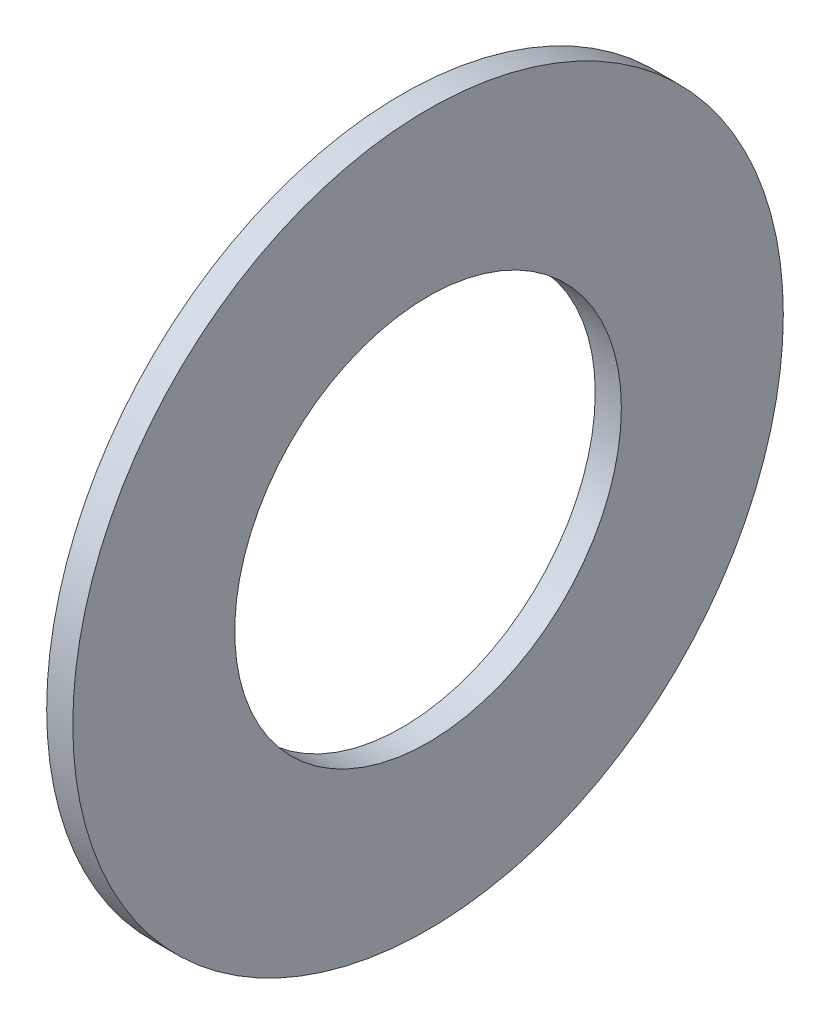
ISO-10303-21;
HEADER;
FILE_DESCRIPTION(('STEP AP214'),'2;1');
FILE_NAME('part.step','',(''),(''),'','','');
FILE_SCHEMA(('AUTOMOTIVE_DESIGN { 1 0 10303 214 1 1 1 1 }'));
ENDSEC;
DATA;
#1=APPLICATION_CONTEXT('core data for automotive mechanical design processes');
#2=APPLICATION_PROTOCOL_DEFINITION('international standard','automotive_design',2000,#1);
#3=PRODUCT_CONTEXT('',#1,'mechanical');
#4=PRODUCT('Part','Part','',(#3));
#5=PRODUCT_RELATED_PRODUCT_CATEGORY('part','',(#4));
#6=PRODUCT_DEFINITION_FORMATION('','',#4);
#7=PRODUCT_DEFINITION_CONTEXT('part definition',#1,'design');
#8=PRODUCT_DEFINITION('design','',#6,#7);
#9=PRODUCT_DEFINITION_SHAPE('','',#8);
#10=(LENGTH_UNIT() NAMED_UNIT(*) SI_UNIT(.MILLI.,.METRE.));
#11=(NAMED_UNIT(*) PLANE_ANGLE_UNIT() SI_UNIT($,.RADIAN.));
#12=(NAMED_UNIT(*) SI_UNIT($,.STERADIAN.) SOLID_ANGLE_UNIT());
#13=UNCERTAINTY_MEASURE_WITH_UNIT(LENGTH_MEASURE(1.E-05),#10,'distance_accuracy_value','');
#14=(GEOMETRIC_REPRESENTATION_CONTEXT(3) GLOBAL_UNCERTAINTY_ASSIGNED_CONTEXT((#13)) GLOBAL_UNIT_ASSIGNED_CONTEXT((#10,
#11,#12)) REPRESENTATION_CONTEXT('',''));
#15=CARTESIAN_POINT('',(0.,0.,0.));
#16=DIRECTION('',(0.,0.,1.));
#17=DIRECTION('',(1.,0.,0.));
#18=AXIS2_PLACEMENT_3D('',#15,#16,#17);
#19=CARTESIAN_POINT('',(2.5,0.,0.));
#20=DIRECTION('',(1.,0.,0.));
#21=DIRECTION('',(0.,0.,-1.));
#22=AXIS2_PLACEMENT_3D('',#19,#20,#21);
#23=PLANE('',#22);
#24=CARTESIAN_POINT('',(2.5,0.,0.));
#25=DIRECTION('',(1.,0.,0.));
#26=DIRECTION('',(0.,0.,-1.));
#27=AXIS2_PLACEMENT_3D('',#24,#25,#26);
#28=CIRCLE('',#27,34.);
#29=CARTESIAN_POINT('',(2.5,0.,-34.));
#30=VERTEX_POINT('',#29);
#31=EDGE_CURVE('E10',#30,#30,#28,.T.);
#32=ORIENTED_EDGE('',*,*,#31,.T.);
#33=EDGE_LOOP('',(#32));
#34=FACE_BOUND('',#33,.T.);
#35=CARTESIAN_POINT('',(2.5,0.,0.));
#36=DIRECTION('',(1.,0.,0.));
#37=DIRECTION('',(0.,0.,-1.));
#38=AXIS2_PLACEMENT_3D('',#35,#36,#37);
#39=CIRCLE('',#38,18.5);
#40=CARTESIAN_POINT('',(2.5,0.,-18.5));
#41=VERTEX_POINT('',#40);
#42=EDGE_CURVE('E41',#41,#41,#39,.T.);
#43=ORIENTED_EDGE('',*,*,#42,.F.);
#44=EDGE_LOOP('',(#43));
#45=FACE_BOUND('',#44,.T.);
#46=ADVANCED_FACE('F30',(#34,#45),#23,.T.);
#47=CARTESIAN_POINT('',(0.,0.,0.));
#48=DIRECTION('',(1.,0.,0.));
#49=DIRECTION('',(0.,0.,-1.));
#50=AXIS2_PLACEMENT_3D('',#47,#48,#49);
#51=PLANE('',#50);
#52=CARTESIAN_POINT('',(0.,0.,0.));
#53=DIRECTION('',(1.,0.,0.));
#54=DIRECTION('',(0.,0.,-1.));
#55=AXIS2_PLACEMENT_3D('',#52,#53,#54);
#56=CIRCLE('',#55,34.);
#57=CARTESIAN_POINT('',(0.,0.,-34.));
#58=VERTEX_POINT('',#57);
#59=EDGE_CURVE('E34',#58,#58,#56,.T.);
#60=ORIENTED_EDGE('',*,*,#59,.F.);
#61=EDGE_LOOP('',(#60));
#62=FACE_BOUND('',#61,.T.);
#63=CARTESIAN_POINT('',(0.,0.,0.));
#64=DIRECTION('',(1.,0.,0.));
#65=DIRECTION('',(0.,0.,-1.));
#66=AXIS2_PLACEMENT_3D('',#63,#64,#65);
#67=CIRCLE('',#66,18.5);
#68=CARTESIAN_POINT('',(0.,0.,-18.5));
#69=VERTEX_POINT('',#68);
#70=EDGE_CURVE('E43',#69,#69,#67,.T.);
#71=ORIENTED_EDGE('',*,*,#70,.T.);
#72=EDGE_LOOP('',(#71));
#73=FACE_BOUND('',#72,.T.);
#74=ADVANCED_FACE('F53',(#62,#73),#51,.F.);
#75=CARTESIAN_POINT('',(2.5,0.,0.));
#76=DIRECTION('',(-1.,0.,0.));
#77=DIRECTION('',(0.,0.,1.));
#78=AXIS2_PLACEMENT_3D('',#75,#76,#77);
#79=CYLINDRICAL_SURFACE('',#78,34.);
#80=ORIENTED_EDGE('',*,*,#31,.F.);
#81=EDGE_LOOP('',(#80));
#82=FACE_BOUND('',#81,.T.);
#83=ORIENTED_EDGE('',*,*,#59,.T.);
#84=EDGE_LOOP('',(#83));
#85=FACE_BOUND('',#84,.T.);
#86=ADVANCED_FACE('F32',(#82,#85),#79,.T.);
#87=CARTESIAN_POINT('',(2.5,0.,0.));
#88=DIRECTION('',(-1.,0.,0.));
#89=DIRECTION('',(0.,0.,1.));
#90=AXIS2_PLACEMENT_3D('',#87,#88,#89);
#91=CYLINDRICAL_SURFACE('',#90,18.5);
#92=ORIENTED_EDGE('',*,*,#42,.T.);
#93=EDGE_LOOP('',(#92));
#94=FACE_BOUND('',#93,.T.);
#95=ORIENTED_EDGE('',*,*,#70,.F.);
#96=EDGE_LOOP('',(#95));
#97=FACE_BOUND('',#96,.T.);
#98=ADVANCED_FACE('F49',(#94,#97),#91,.F.);
#99=CLOSED_SHELL('',(#46,#74,#86,#98));
#100=MANIFOLD_SOLID_BREP('B2',#99);
#101=ADVANCED_BREP_SHAPE_REPRESENTATION('',(#18,#100),#14);
#102=SHAPE_DEFINITION_REPRESENTATION(#9,#101);
ENDSEC;
END-ISO-10303-21;
